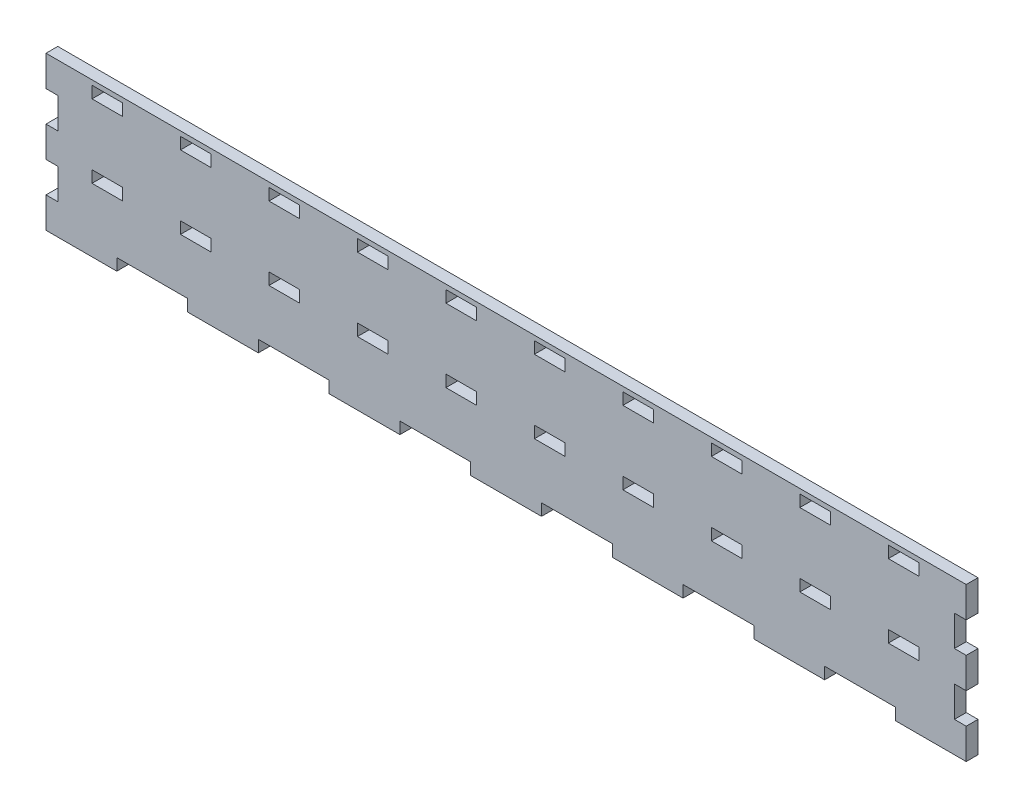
from build123d import *

# Parameters (mm, degrees)
ESQUISSE1_W                    = 390
ESQUISSE1_H                    = 65
BOSS_EXTRU_1_DEPTH             = 5
ESQUISSE2_W                    = 30
ESQUISSE2_H                    = 5
ENL_V_MAT_EXTRU_1_DEPTH        = 5
R_P_TITION_LIN_AIRE1_COUNT     = 6
R_P_TITION_LIN_AIRE1_PITCH     = 60
ESQUISSE3_W                    = 5
ESQUISSE3_H                    = 13
ENL_V_MAT_EXTRU_2_DEPTH        = 5
R_P_TITION_LIN_AIRE2_COUNT     = 2
R_P_TITION_LIN_AIRE2_PITCH     = 26
SYM_TRIE1_COPY_1_SKETCH_W      = 5
SYM_TRIE1_COPY_1_SKETCH_H      = 13
SYM_TRIE1_COPY_1_DEPTH         = 5
ESQUISSE4_W                    = 13
ESQUISSE4_H                    = 5
ENL_V_MAT_EXTRU_3_DEPTH        = 5
R_P_TITION_LIN_AIRE3_COUNT     = 2
R_P_TITION_LIN_AIRE3_PITCH     = 37.5
R_P_TITION_LIN_AIRE3_COL_COUNT = 9
R_P_TITION_LIN_AIRE3_COL_PITCH = 37.5


with BuildPart() as part:
    # Esquisse1 → Boss.-Extru.1 (new body)
    with BuildSketch(Plane.XY):
        with Locations((195, -32.5)):
            Rectangle(ESQUISSE1_W, ESQUISSE1_H)
    extrude(amount=BOSS_EXTRU_1_DEPTH)

    # Esquisse2 → Enl_v. mat.-Extru.1 (cut)
    with BuildSketch(Plane.XY.offset(5)):
        with Locations((45, -62.5)):
            Rectangle(ESQUISSE2_W, ESQUISSE2_H)
    enl_v_mat_extru_1 = extrude(amount=-ENL_V_MAT_EXTRU_1_DEPTH, mode=Mode.SUBTRACT)

    # R_p_tition lin_aire1: Enl_v. mat.-Extru.1 ×6
    with Locations(*[(i * R_P_TITION_LIN_AIRE1_PITCH, 0, 0) for i in range(1, R_P_TITION_LIN_AIRE1_COUNT)]):
        add(enl_v_mat_extru_1, mode=Mode.SUBTRACT)

    # Esquisse3 → Enl_v. mat.-Extru.2 (cut)
    with BuildSketch(Plane.XY.offset(5)):
        with Locations((2.5, -45.5)):
            Rectangle(ESQUISSE3_W, ESQUISSE3_H)
    enl_v_mat_extru_2 = extrude(amount=-ENL_V_MAT_EXTRU_2_DEPTH, mode=Mode.SUBTRACT)

    # R_p_tition lin_aire2: Enl_v. mat.-Extru.2 ×2
    with Locations(*[(0, i * R_P_TITION_LIN_AIRE2_PITCH, 0) for i in range(1, R_P_TITION_LIN_AIRE2_COUNT)]):
        add(enl_v_mat_extru_2, mode=Mode.SUBTRACT)

    # Sym_trie1: Enl_v. mat.-Extru.2 across plane
    add(enl_v_mat_extru_2.mirror(Plane.ZY.offset(-195)), mode=Mode.SUBTRACT)

    # Sym_trie1 copy 1 sketch → Sym_trie1 copy 1 (cut)
    with BuildSketch(Plane(origin=(390, 26, 5), x_dir=(-1, 0, 0), z_dir=(0, 0, 1))):
        with Locations((2.5, 45.5)):
            Rectangle(SYM_TRIE1_COPY_1_SKETCH_W, SYM_TRIE1_COPY_1_SKETCH_H)
    extrude(amount=-SYM_TRIE1_COPY_1_DEPTH, mode=Mode.SUBTRACT)

    # Esquisse4 → Enl_v. mat.-Extru.3 (cut)
    with BuildSketch(Plane.XY.offset(5)):
        with Locations((63.5, -35.5)):
            Rectangle(ESQUISSE4_W, ESQUISSE4_H)
        with Locations((63.5, -4.5)):
            Rectangle(ESQUISSE4_W, ESQUISSE4_H)
    enl_v_mat_extru_3 = extrude(amount=-ENL_V_MAT_EXTRU_3_DEPTH, mode=Mode.SUBTRACT)

    # R_p_tition lin_aire3: Enl_v. mat.-Extru.3 ×2
    with Locations(*[(-i * R_P_TITION_LIN_AIRE3_PITCH, 0, 0) for i in range(1, R_P_TITION_LIN_AIRE3_COUNT)]):
        add(enl_v_mat_extru_3, mode=Mode.SUBTRACT)

    # R_p_tition lin_aire3 col: Enl_v. mat.-Extru.3 ×9
    with Locations(*[(i * R_P_TITION_LIN_AIRE3_COL_PITCH, 0, 0) for i in range(1, R_P_TITION_LIN_AIRE3_COL_COUNT)]):
        add(enl_v_mat_extru_3, mode=Mode.SUBTRACT)


solid = part.part
